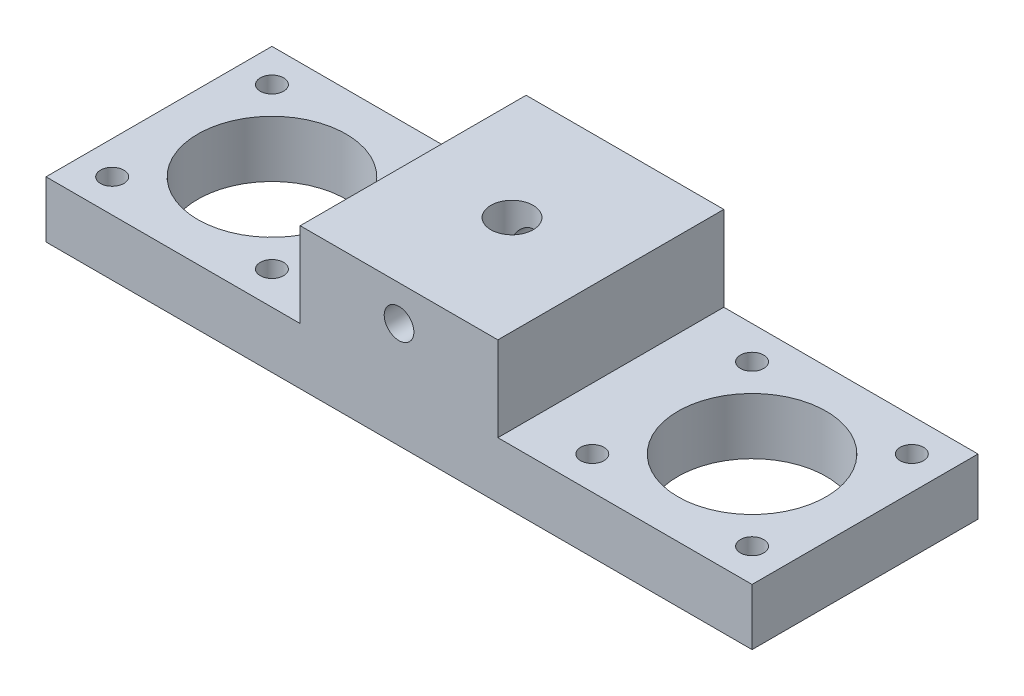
ISO-10303-21;
HEADER;
FILE_DESCRIPTION(('STEP AP214'),'2;1');
FILE_NAME('part.step','',(''),(''),'','','');
FILE_SCHEMA(('AUTOMOTIVE_DESIGN { 1 0 10303 214 1 1 1 1 }'));
ENDSEC;
DATA;
#1=APPLICATION_CONTEXT('core data for automotive mechanical design processes');
#2=APPLICATION_PROTOCOL_DEFINITION('international standard','automotive_design',2000,#1);
#3=PRODUCT_CONTEXT('',#1,'mechanical');
#4=PRODUCT('Part','Part','',(#3));
#5=PRODUCT_RELATED_PRODUCT_CATEGORY('part','',(#4));
#6=PRODUCT_DEFINITION_FORMATION('','',#4);
#7=PRODUCT_DEFINITION_CONTEXT('part definition',#1,'design');
#8=PRODUCT_DEFINITION('design','',#6,#7);
#9=PRODUCT_DEFINITION_SHAPE('','',#8);
#10=(LENGTH_UNIT() NAMED_UNIT(*) SI_UNIT(.MILLI.,.METRE.));
#11=(NAMED_UNIT(*) PLANE_ANGLE_UNIT() SI_UNIT($,.RADIAN.));
#12=(NAMED_UNIT(*) SI_UNIT($,.STERADIAN.) SOLID_ANGLE_UNIT());
#13=UNCERTAINTY_MEASURE_WITH_UNIT(LENGTH_MEASURE(1.E-05),#10,'distance_accuracy_value','');
#14=(GEOMETRIC_REPRESENTATION_CONTEXT(3) GLOBAL_UNCERTAINTY_ASSIGNED_CONTEXT((#13)) GLOBAL_UNIT_ASSIGNED_CONTEXT((#10,
#11,#12)) REPRESENTATION_CONTEXT('',''));
#15=CARTESIAN_POINT('',(0.,0.,0.));
#16=DIRECTION('',(0.,0.,1.));
#17=DIRECTION('',(1.,0.,0.));
#18=AXIS2_PLACEMENT_3D('',#15,#16,#17);
#19=CARTESIAN_POINT('',(0.,10.,0.));
#20=DIRECTION('',(0.,1.,0.));
#21=DIRECTION('',(0.,0.,1.));
#22=AXIS2_PLACEMENT_3D('',#19,#20,#21);
#23=CYLINDRICAL_SURFACE('',#22,3.);
#24=CARTESIAN_POINT('',(2.09999999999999,15.,2.14242852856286));
#25=CARTESIAN_POINT('',(2.09999935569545,15.0503500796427,2.14242969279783));
#26=CARTESIAN_POINT('',(2.09818319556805,15.1007182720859,2.14421462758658));
#27=CARTESIAN_POINT('',(2.09096784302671,15.2009663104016,2.15124967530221));
#28=CARTESIAN_POINT('',(2.08556595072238,15.2508457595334,2.15650239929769));
#29=CARTESIAN_POINT('',(2.06410630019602,15.3993103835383,2.17712653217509));
#30=CARTESIAN_POINT('',(2.04279523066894,15.4965210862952,2.19736230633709));
#31=CARTESIAN_POINT('',(1.98804341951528,15.6834534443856,2.24699824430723));
#32=CARTESIAN_POINT('',(1.95474567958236,15.7732486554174,2.27628981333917));
#33=CARTESIAN_POINT('',(1.87735088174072,15.9457731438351,2.34053116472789));
#34=CARTESIAN_POINT('',(1.83325566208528,16.0285036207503,2.3754799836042));
#35=CARTESIAN_POINT('',(1.72654194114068,16.2004219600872,2.45442194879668));
#36=CARTESIAN_POINT('',(1.66203137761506,16.2881996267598,2.4989266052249));
#37=CARTESIAN_POINT('',(1.52013071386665,16.4529396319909,2.58770730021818));
#38=CARTESIAN_POINT('',(1.44272540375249,16.5298889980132,2.63198300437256));
#39=CARTESIAN_POINT('',(1.26176132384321,16.6835329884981,2.723947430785));
#40=CARTESIAN_POINT('',(1.15599397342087,16.7580597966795,2.77098041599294));
#41=CARTESIAN_POINT('',(0.929495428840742,16.8875861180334,2.85491810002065));
#42=CARTESIAN_POINT('',(0.808785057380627,16.9426124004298,2.89183666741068));
#43=CARTESIAN_POINT('',(0.574412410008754,17.0231344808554,2.94658126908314));
#44=CARTESIAN_POINT('',(0.462309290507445,17.0517759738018,2.96641229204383));
#45=CARTESIAN_POINT('',(0.233454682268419,17.0901936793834,2.99311056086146));
#46=CARTESIAN_POINT('',(0.116709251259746,17.0999937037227,2.99999416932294));
#47=CARTESIAN_POINT('',(-0.104433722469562,17.1000056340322,3.00000521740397));
#48=CARTESIAN_POINT('',(-0.208838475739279,17.0921694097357,2.99450338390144));
#49=CARTESIAN_POINT('',(-0.414281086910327,17.06134982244,2.97305239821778));
#50=CARTESIAN_POINT('',(-0.515317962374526,17.0383620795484,2.95710022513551));
#51=CARTESIAN_POINT('',(-0.710737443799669,16.9787000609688,2.91629642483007));
#52=CARTESIAN_POINT('',(-0.805149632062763,16.9420919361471,2.89148783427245));
#53=CARTESIAN_POINT('',(-0.986035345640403,16.856810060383,2.83491211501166));
#54=CARTESIAN_POINT('',(-1.07250773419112,16.8081345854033,2.80314399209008));
#55=CARTESIAN_POINT('',(-1.24369991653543,16.695471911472,2.73176734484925));
#56=CARTESIAN_POINT('',(-1.32759007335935,16.6305119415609,2.69171411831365));
#57=CARTESIAN_POINT('',(-1.48403850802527,16.4895433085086,2.60873348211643));
#58=CARTESIAN_POINT('',(-1.5565797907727,16.4135183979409,2.56580189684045));
#59=CARTESIAN_POINT('',(-1.70136529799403,16.2371685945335,2.47264832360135));
#60=CARTESIAN_POINT('',(-1.77131287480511,16.1349215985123,2.4224722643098));
#61=CARTESIAN_POINT('',(-1.893093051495,15.9174256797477,2.32854122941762));
#62=CARTESIAN_POINT('',(-1.944950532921,15.8021949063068,2.28477748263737));
#63=CARTESIAN_POINT('',(-2.01523817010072,15.5972446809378,2.22268049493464));
#64=CARTESIAN_POINT('',(-2.03904064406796,15.5104897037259,2.20066282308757));
#65=CARTESIAN_POINT('',(-2.07540375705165,15.3329246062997,2.16641252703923));
#66=CARTESIAN_POINT('',(-2.08800521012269,15.2421304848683,2.15414439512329));
#67=CARTESIAN_POINT('',(-2.09639230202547,15.1255997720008,2.14595908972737));
#68=CARTESIAN_POINT('',(-2.09774348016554,15.1005235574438,2.14463816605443));
#69=CARTESIAN_POINT('',(-2.09954759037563,15.0502997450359,2.14287249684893));
#70=CARTESIAN_POINT('',(-2.10000032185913,15.0251521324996,2.14242794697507));
#71=CARTESIAN_POINT('',(-2.09999935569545,14.9496499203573,2.14242969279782));
#72=CARTESIAN_POINT('',(-2.09818319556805,14.8992817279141,2.14421462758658));
#73=CARTESIAN_POINT('',(-2.09096784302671,14.7990336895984,2.15124967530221));
#74=CARTESIAN_POINT('',(-2.08556595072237,14.7491542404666,2.15650239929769));
#75=CARTESIAN_POINT('',(-2.06410630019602,14.6006896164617,2.17712653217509));
#76=CARTESIAN_POINT('',(-2.04279523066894,14.5034789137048,2.19736230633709));
#77=CARTESIAN_POINT('',(-1.98804341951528,14.3165465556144,2.24699824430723));
#78=CARTESIAN_POINT('',(-1.95474567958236,14.2267513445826,2.27628981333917));
#79=CARTESIAN_POINT('',(-1.87735088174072,14.0542268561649,2.34053116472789));
#80=CARTESIAN_POINT('',(-1.83325566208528,13.9714963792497,2.3754799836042));
#81=CARTESIAN_POINT('',(-1.72654194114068,13.7995780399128,2.45442194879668));
#82=CARTESIAN_POINT('',(-1.66203137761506,13.7118003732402,2.4989266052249));
#83=CARTESIAN_POINT('',(-1.52013071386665,13.5470603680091,2.58770730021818));
#84=CARTESIAN_POINT('',(-1.44272540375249,13.4701110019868,2.63198300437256));
#85=CARTESIAN_POINT('',(-1.2617613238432,13.3164670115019,2.723947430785));
#86=CARTESIAN_POINT('',(-1.15599397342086,13.2419402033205,2.77098041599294));
#87=CARTESIAN_POINT('',(-0.929495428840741,13.1124138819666,2.85491810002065));
#88=CARTESIAN_POINT('',(-0.808785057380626,13.0573875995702,2.89183666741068));
#89=CARTESIAN_POINT('',(-0.574412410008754,12.9768655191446,2.94658126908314));
#90=CARTESIAN_POINT('',(-0.462309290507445,12.9482240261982,2.96641229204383));
#91=CARTESIAN_POINT('',(-0.23345468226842,12.9098063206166,2.99311056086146));
#92=CARTESIAN_POINT('',(-0.116709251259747,12.9000062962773,2.99999416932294));
#93=CARTESIAN_POINT('',(0.10443372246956,12.8999943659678,3.00000521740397));
#94=CARTESIAN_POINT('',(0.208838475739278,12.9078305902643,2.99450338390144));
#95=CARTESIAN_POINT('',(0.414281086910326,12.93865017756,2.97305239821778));
#96=CARTESIAN_POINT('',(0.515317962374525,12.9616379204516,2.95710022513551));
#97=CARTESIAN_POINT('',(0.710737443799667,13.0212999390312,2.91629642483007));
#98=CARTESIAN_POINT('',(0.80514963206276,13.0579080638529,2.89148783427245));
#99=CARTESIAN_POINT('',(0.9860353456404,13.143189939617,2.83491211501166));
#100=CARTESIAN_POINT('',(1.07250773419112,13.1918654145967,2.80314399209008));
#101=CARTESIAN_POINT('',(1.24369991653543,13.304528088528,2.73176734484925));
#102=CARTESIAN_POINT('',(1.32759007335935,13.3694880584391,2.69171411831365));
#103=CARTESIAN_POINT('',(1.48403850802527,13.5104566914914,2.60873348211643));
#104=CARTESIAN_POINT('',(1.5565797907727,13.5864816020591,2.56580189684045));
#105=CARTESIAN_POINT('',(1.70136529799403,13.7628314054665,2.47264832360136));
#106=CARTESIAN_POINT('',(1.77131287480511,13.8650784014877,2.4224722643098));
#107=CARTESIAN_POINT('',(1.893093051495,14.0825743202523,2.32854122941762));
#108=CARTESIAN_POINT('',(1.944950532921,14.1978050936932,2.28477748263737));
#109=CARTESIAN_POINT('',(2.01523817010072,14.4027553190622,2.22268049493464));
#110=CARTESIAN_POINT('',(2.03904064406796,14.4895102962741,2.20066282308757));
#111=CARTESIAN_POINT('',(2.07540375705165,14.6670753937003,2.16641252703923));
#112=CARTESIAN_POINT('',(2.08800521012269,14.7578695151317,2.15414439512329));
#113=CARTESIAN_POINT('',(2.09639230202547,14.8744002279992,2.14595908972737));
#114=CARTESIAN_POINT('',(2.09774348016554,14.8994764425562,2.14463816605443));
#115=CARTESIAN_POINT('',(2.09954759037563,14.9497002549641,2.14287249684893));
#116=CARTESIAN_POINT('',(2.10000032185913,14.9748478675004,2.14242794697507));
#117=CARTESIAN_POINT('',(2.09999999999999,15.,2.14242852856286));
#118=B_SPLINE_CURVE_WITH_KNOTS('',3,(#24,#25,#26,#27,#28,#29,#30,#31,#32,#33,#34,#35,#36,#37,
#38,#39,#40,#41,#42,#43,#44,#45,#46,#47,#48,#49,#50,#51,#52,#53,#54,#55,#56,#57,#58,#59,#60,#61,
#62,#63,#64,#65,#66,#67,#68,#69,#70,#71,#72,#73,#74,#75,#76,#77,#78,#79,#80,#81,#82,#83,#84,#85,
#86,#87,#88,#89,#90,#91,#92,#93,#94,#95,#96,#97,#98,#99,#100,#101,#102,#103,#104,#105,#106,#107,
#108,#109,#110,#111,#112,#113,#114,#115,#116,#117),.UNSPECIFIED.,.T.,.F.,(4,2,2,2,2,2,2,2,2,2,2,
2,2,2,2,2,2,2,2,2,2,2,2,2,2,2,2,2,2,2,2,2,2,2,2,2,2,2,2,2,2,2,2,2,2,2,4),(0.,0.151013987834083,
0.302141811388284,0.604989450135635,0.904337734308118,1.20363509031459,1.55539742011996,
1.90757764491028,2.31828952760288,2.72843540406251,3.07848062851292,3.42808317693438,
3.74091438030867,4.05383605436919,4.3652573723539,4.67672320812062,5.01570368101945,
5.35518702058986,5.75438428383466,6.15303029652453,6.42985740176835,6.70567162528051,
6.78109307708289,6.85653136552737,7.00754535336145,7.15867317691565,7.461520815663,
7.76086909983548,8.06016645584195,8.41192878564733,8.76410901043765,9.17482089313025,
9.58496676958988,9.93501199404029,10.2846145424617,10.597445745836,10.9103674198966,
11.2217887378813,11.533254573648,11.8722350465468,12.2117183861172,12.610915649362,
13.0095616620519,13.2863887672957,13.5622029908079,13.6376244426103,13.7130627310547),.UNSPECIFIED.);
#119=CARTESIAN_POINT('',(2.09999999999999,15.,2.14242852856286));
#120=VERTEX_POINT('',#119);
#121=EDGE_CURVE('E194',#120,#120,#118,.T.);
#122=ORIENTED_EDGE('',*,*,#121,.T.);
#123=EDGE_LOOP('',(#122));
#124=FACE_BOUND('',#123,.T.);
#125=CARTESIAN_POINT('',(0.,20.,0.));
#126=DIRECTION('',(0.,1.,0.));
#127=DIRECTION('',(0.,0.,1.));
#128=AXIS2_PLACEMENT_3D('',#125,#126,#127);
#129=CIRCLE('',#128,3.);
#130=CARTESIAN_POINT('',(0.,20.,3.));
#131=VERTEX_POINT('',#130);
#132=EDGE_CURVE('E122',#131,#131,#129,.F.);
#133=ORIENTED_EDGE('',*,*,#132,.F.);
#134=EDGE_LOOP('',(#133));
#135=FACE_BOUND('',#134,.T.);
#136=CARTESIAN_POINT('',(-2.09999999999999,15.,-2.14242852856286));
#137=CARTESIAN_POINT('',(-2.09999935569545,15.0503500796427,-2.14242969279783));
#138=CARTESIAN_POINT('',(-2.09818319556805,15.1007182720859,-2.14421462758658));
#139=CARTESIAN_POINT('',(-2.09096784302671,15.2009663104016,-2.15124967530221));
#140=CARTESIAN_POINT('',(-2.08556595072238,15.2508457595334,-2.15650239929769));
#141=CARTESIAN_POINT('',(-2.06410630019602,15.3993103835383,-2.17712653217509));
#142=CARTESIAN_POINT('',(-2.04279523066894,15.4965210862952,-2.19736230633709));
#143=CARTESIAN_POINT('',(-1.98804341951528,15.6834534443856,-2.24699824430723));
#144=CARTESIAN_POINT('',(-1.95474567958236,15.7732486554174,-2.27628981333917));
#145=CARTESIAN_POINT('',(-1.87735088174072,15.9457731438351,-2.34053116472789));
#146=CARTESIAN_POINT('',(-1.83325566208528,16.0285036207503,-2.3754799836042));
#147=CARTESIAN_POINT('',(-1.72654194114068,16.2004219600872,-2.45442194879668));
#148=CARTESIAN_POINT('',(-1.66203137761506,16.2881996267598,-2.4989266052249));
#149=CARTESIAN_POINT('',(-1.52013071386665,16.4529396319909,-2.58770730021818));
#150=CARTESIAN_POINT('',(-1.44272540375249,16.5298889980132,-2.63198300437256));
#151=CARTESIAN_POINT('',(-1.2617613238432,16.6835329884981,-2.723947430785));
#152=CARTESIAN_POINT('',(-1.15599397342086,16.7580597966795,-2.77098041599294));
#153=CARTESIAN_POINT('',(-0.929495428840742,16.8875861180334,-2.85491810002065));
#154=CARTESIAN_POINT('',(-0.808785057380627,16.9426124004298,-2.89183666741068));
#155=CARTESIAN_POINT('',(-0.574412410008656,17.0231344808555,-2.94658126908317));
#156=CARTESIAN_POINT('',(-0.462309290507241,17.0517759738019,-2.96641229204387));
#157=CARTESIAN_POINT('',(-0.233454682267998,17.0901936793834,-2.99311056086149));
#158=CARTESIAN_POINT('',(-0.116709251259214,17.0999937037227,-2.99999416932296));
#159=CARTESIAN_POINT('',(0.104433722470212,17.1000056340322,-3.00000521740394));
#160=CARTESIAN_POINT('',(0.208838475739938,17.0921694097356,-2.9945033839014));
#161=CARTESIAN_POINT('',(0.414281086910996,17.0613498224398,-2.97305239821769));
#162=CARTESIAN_POINT('',(0.515317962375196,17.0383620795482,-2.95710022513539));
#163=CARTESIAN_POINT('',(0.710737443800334,16.9787000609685,-2.91629642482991));
#164=CARTESIAN_POINT('',(0.80514963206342,16.9420919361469,-2.89148783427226));
#165=CARTESIAN_POINT('',(0.986035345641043,16.8568100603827,-2.83491211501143));
#166=CARTESIAN_POINT('',(1.07250773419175,16.808134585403,-2.80314399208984));
#167=CARTESIAN_POINT('',(1.24369991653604,16.6954719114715,-2.73176734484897));
#168=CARTESIAN_POINT('',(1.32759007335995,16.6305119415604,-2.69171411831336));
#169=CARTESIAN_POINT('',(1.48403850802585,16.489543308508,-2.60873348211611));
#170=CARTESIAN_POINT('',(1.55657979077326,16.4135183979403,-2.56580189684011));
#171=CARTESIAN_POINT('',(1.70136529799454,16.2371685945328,-2.472648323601));
#172=CARTESIAN_POINT('',(1.7713128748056,16.1349215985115,-2.42247226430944));
#173=CARTESIAN_POINT('',(1.89309305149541,15.9174256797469,-2.32854122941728));
#174=CARTESIAN_POINT('',(1.94495053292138,15.8021949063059,-2.28477748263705));
#175=CARTESIAN_POINT('',(2.015238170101,15.5972446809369,-2.22268049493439));
#176=CARTESIAN_POINT('',(2.03904064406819,15.510489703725,-2.20066282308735));
#177=CARTESIAN_POINT('',(2.0754037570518,15.3329246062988,-2.16641252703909));
#178=CARTESIAN_POINT('',(2.0880052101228,15.2421304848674,-2.15414439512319));
#179=CARTESIAN_POINT('',(2.09639230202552,15.1255997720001,-2.14595908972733));
#180=CARTESIAN_POINT('',(2.09774348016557,15.1005235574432,-2.1446381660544));
#181=CARTESIAN_POINT('',(2.09954759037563,15.0502997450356,-2.14287249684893));
#182=CARTESIAN_POINT('',(2.10000032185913,15.0251521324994,-2.14242794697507));
#183=CARTESIAN_POINT('',(2.09999935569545,14.9496499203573,-2.14242969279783));
#184=CARTESIAN_POINT('',(2.09818319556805,14.8992817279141,-2.14421462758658));
#185=CARTESIAN_POINT('',(2.09096784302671,14.7990336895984,-2.15124967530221));
#186=CARTESIAN_POINT('',(2.08556595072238,14.7491542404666,-2.15650239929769));
#187=CARTESIAN_POINT('',(2.06410630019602,14.6006896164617,-2.17712653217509));
#188=CARTESIAN_POINT('',(2.04279523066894,14.5034789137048,-2.19736230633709));
#189=CARTESIAN_POINT('',(1.98804341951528,14.3165465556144,-2.24699824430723));
#190=CARTESIAN_POINT('',(1.95474567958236,14.2267513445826,-2.27628981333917));
#191=CARTESIAN_POINT('',(1.87735088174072,14.0542268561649,-2.34053116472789));
#192=CARTESIAN_POINT('',(1.83325566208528,13.9714963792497,-2.3754799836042));
#193=CARTESIAN_POINT('',(1.72654194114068,13.7995780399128,-2.45442194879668));
#194=CARTESIAN_POINT('',(1.66203137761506,13.7118003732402,-2.4989266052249));
#195=CARTESIAN_POINT('',(1.52013071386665,13.5470603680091,-2.58770730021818));
#196=CARTESIAN_POINT('',(1.44272540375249,13.4701110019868,-2.63198300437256));
#197=CARTESIAN_POINT('',(1.26176132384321,13.3164670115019,-2.723947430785));
#198=CARTESIAN_POINT('',(1.15599397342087,13.2419402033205,-2.77098041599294));
#199=CARTESIAN_POINT('',(0.929495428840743,13.1124138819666,-2.85491810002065));
#200=CARTESIAN_POINT('',(0.808785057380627,13.0573875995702,-2.89183666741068));
#201=CARTESIAN_POINT('',(0.574412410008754,12.9768655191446,-2.94658126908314));
#202=CARTESIAN_POINT('',(0.462309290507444,12.9482240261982,-2.96641229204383));
#203=CARTESIAN_POINT('',(0.23345468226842,12.9098063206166,-2.99311056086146));
#204=CARTESIAN_POINT('',(0.116709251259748,12.9000062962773,-2.99999416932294));
#205=CARTESIAN_POINT('',(-0.104433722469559,12.8999943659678,-3.00000521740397));
#206=CARTESIAN_POINT('',(-0.208838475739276,12.9078305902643,-2.99450338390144));
#207=CARTESIAN_POINT('',(-0.414281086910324,12.93865017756,-2.97305239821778));
#208=CARTESIAN_POINT('',(-0.515317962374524,12.9616379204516,-2.95710022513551));
#209=CARTESIAN_POINT('',(-0.710737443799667,13.0212999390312,-2.91629642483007));
#210=CARTESIAN_POINT('',(-0.805149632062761,13.0579080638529,-2.89148783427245));
#211=CARTESIAN_POINT('',(-0.986035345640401,13.143189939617,-2.83491211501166));
#212=CARTESIAN_POINT('',(-1.07250773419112,13.1918654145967,-2.80314399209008));
#213=CARTESIAN_POINT('',(-1.24369991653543,13.304528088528,-2.73176734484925));
#214=CARTESIAN_POINT('',(-1.32759007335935,13.3694880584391,-2.69171411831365));
#215=CARTESIAN_POINT('',(-1.48403850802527,13.5104566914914,-2.60873348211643));
#216=CARTESIAN_POINT('',(-1.5565797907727,13.5864816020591,-2.56580189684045));
#217=CARTESIAN_POINT('',(-1.70136529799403,13.7628314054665,-2.47264832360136));
#218=CARTESIAN_POINT('',(-1.77131287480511,13.8650784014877,-2.4224722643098));
#219=CARTESIAN_POINT('',(-1.893093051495,14.0825743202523,-2.32854122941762));
#220=CARTESIAN_POINT('',(-1.944950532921,14.1978050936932,-2.28477748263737));
#221=CARTESIAN_POINT('',(-2.01523817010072,14.4027553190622,-2.22268049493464));
#222=CARTESIAN_POINT('',(-2.03904064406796,14.4895102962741,-2.20066282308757));
#223=CARTESIAN_POINT('',(-2.07540375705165,14.6670753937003,-2.16641252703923));
#224=CARTESIAN_POINT('',(-2.08800521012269,14.7578695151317,-2.15414439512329));
#225=CARTESIAN_POINT('',(-2.09639230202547,14.8744002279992,-2.14595908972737));
#226=CARTESIAN_POINT('',(-2.09774348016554,14.8994764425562,-2.14463816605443));
#227=CARTESIAN_POINT('',(-2.09954759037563,14.9497002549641,-2.14287249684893));
#228=CARTESIAN_POINT('',(-2.10000032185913,14.9748478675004,-2.14242794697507));
#229=CARTESIAN_POINT('',(-2.09999999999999,15.,-2.14242852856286));
#230=B_SPLINE_CURVE_WITH_KNOTS('',3,(#136,#137,#138,#139,#140,#141,#142,#143,#144,#145,#146,
#147,#148,#149,#150,#151,#152,#153,#154,#155,#156,#157,#158,#159,#160,#161,#162,#163,#164,#165,
#166,#167,#168,#169,#170,#171,#172,#173,#174,#175,#176,#177,#178,#179,#180,#181,#182,#183,#184,
#185,#186,#187,#188,#189,#190,#191,#192,#193,#194,#195,#196,#197,#198,#199,#200,#201,#202,#203,
#204,#205,#206,#207,#208,#209,#210,#211,#212,#213,#214,#215,#216,#217,#218,#219,#220,#221,#222,
#223,#224,#225,#226,#227,#228,#229),.UNSPECIFIED.,.T.,.F.,(4,2,2,2,2,2,2,2,2,2,2,2,2,2,2,2,2,2,
2,2,2,2,2,2,2,2,2,2,2,2,2,2,2,2,2,2,2,2,2,2,2,2,2,2,2,2,4),(0.,0.151013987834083,
0.302141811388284,0.604989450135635,0.904337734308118,1.20363509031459,1.55539742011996,
1.90757764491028,2.31828952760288,2.72843540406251,3.07848062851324,3.42808317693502,
3.74091438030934,4.0538360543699,4.36525737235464,4.6767232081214,5.0157036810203,
5.35518702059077,5.75438428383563,6.15303029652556,6.42985740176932,6.70567162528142,
6.78109307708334,6.85653136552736,7.00754535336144,7.15867317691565,7.461520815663,
7.76086909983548,8.06016645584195,8.41192878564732,8.76410901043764,9.17482089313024,
9.58496676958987,9.93501199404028,10.2846145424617,10.597445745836,10.9103674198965,
11.2217887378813,11.533254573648,11.8722350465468,12.2117183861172,12.610915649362,
13.0095616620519,13.2863887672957,13.5622029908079,13.6376244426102,13.7130627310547),.UNSPECIFIED.);
#231=CARTESIAN_POINT('',(-2.09999999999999,15.,-2.14242852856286));
#232=VERTEX_POINT('',#231);
#233=EDGE_CURVE('E199',#232,#232,#230,.T.);
#234=ORIENTED_EDGE('',*,*,#233,.T.);
#235=EDGE_LOOP('',(#234));
#236=FACE_BOUND('',#235,.T.);
#237=CARTESIAN_POINT('',(0.,10.,0.));
#238=DIRECTION('',(0.,1.,0.));
#239=DIRECTION('',(0.,0.,1.));
#240=AXIS2_PLACEMENT_3D('',#237,#238,#239);
#241=CIRCLE('',#240,3.);
#242=CARTESIAN_POINT('',(0.,10.,3.));
#243=VERTEX_POINT('',#242);
#244=EDGE_CURVE('E21',#243,#243,#241,.T.);
#245=ORIENTED_EDGE('',*,*,#244,.F.);
#246=EDGE_LOOP('',(#245));
#247=FACE_BOUND('',#246,.T.);
#248=ADVANCED_FACE('F17',(#124,#135,#236,#247),#23,.F.);
#249=CARTESIAN_POINT('',(0.,10.,0.));
#250=DIRECTION('',(0.,1.,0.));
#251=DIRECTION('',(0.,0.,1.));
#252=AXIS2_PLACEMENT_3D('',#249,#250,#251);
#253=PLANE('',#252);
#254=ORIENTED_EDGE('',*,*,#244,.T.);
#255=EDGE_LOOP('',(#254));
#256=FACE_BOUND('',#255,.T.);
#257=CARTESIAN_POINT('',(0.,10.,0.));
#258=DIRECTION('',(0.,-1.,0.));
#259=DIRECTION('',(0.,0.,-1.));
#260=AXIS2_PLACEMENT_3D('',#257,#258,#259);
#261=CIRCLE('',#260,2.5);
#262=CARTESIAN_POINT('',(0.,10.,-2.5));
#263=VERTEX_POINT('',#262);
#264=EDGE_CURVE('E118',#263,#263,#261,.T.);
#265=ORIENTED_EDGE('',*,*,#264,.T.);
#266=EDGE_LOOP('',(#265));
#267=FACE_BOUND('',#266,.T.);
#268=ADVANCED_FACE('F213',(#256,#267),#253,.T.);
#269=CARTESIAN_POINT('',(0.,15.,16.));
#270=DIRECTION('',(0.,0.,1.));
#271=DIRECTION('',(1.,0.,0.));
#272=AXIS2_PLACEMENT_3D('',#269,#270,#271);
#273=CYLINDRICAL_SURFACE('',#272,2.09999999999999);
#274=CARTESIAN_POINT('',(0.,15.,-16.));
#275=DIRECTION('',(0.,0.,1.));
#276=DIRECTION('',(1.,0.,0.));
#277=AXIS2_PLACEMENT_3D('',#274,#275,#276);
#278=CIRCLE('',#277,2.09999999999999);
#279=CARTESIAN_POINT('',(2.09999999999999,15.,-16.));
#280=VERTEX_POINT('',#279);
#281=EDGE_CURVE('E111',#280,#280,#278,.F.);
#282=ORIENTED_EDGE('',*,*,#281,.T.);
#283=EDGE_LOOP('',(#282));
#284=FACE_BOUND('',#283,.T.);
#285=ORIENTED_EDGE('',*,*,#233,.F.);
#286=EDGE_LOOP('',(#285));
#287=FACE_BOUND('',#286,.T.);
#288=ADVANCED_FACE('F208',(#284,#287),#273,.F.);
#289=CARTESIAN_POINT('',(0.,15.,16.));
#290=DIRECTION('',(0.,0.,1.));
#291=DIRECTION('',(1.,0.,0.));
#292=AXIS2_PLACEMENT_3D('',#289,#290,#291);
#293=CYLINDRICAL_SURFACE('',#292,2.09999999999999);
#294=ORIENTED_EDGE('',*,*,#121,.F.);
#295=EDGE_LOOP('',(#294));
#296=FACE_BOUND('',#295,.T.);
#297=CARTESIAN_POINT('',(0.,15.,16.));
#298=DIRECTION('',(0.,0.,1.));
#299=DIRECTION('',(1.,0.,0.));
#300=AXIS2_PLACEMENT_3D('',#297,#298,#299);
#301=CIRCLE('',#300,2.09999999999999);
#302=CARTESIAN_POINT('',(2.09999999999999,15.,16.));
#303=VERTEX_POINT('',#302);
#304=EDGE_CURVE('E171',#303,#303,#301,.T.);
#305=ORIENTED_EDGE('',*,*,#304,.T.);
#306=EDGE_LOOP('',(#305));
#307=FACE_BOUND('',#306,.T.);
#308=ADVANCED_FACE('F203',(#296,#307),#293,.F.);
#309=CARTESIAN_POINT('',(-14.,0.,-16.));
#310=DIRECTION('',(-1.,0.,0.));
#311=DIRECTION('',(0.,0.,1.));
#312=AXIS2_PLACEMENT_3D('',#309,#310,#311);
#313=PLANE('',#312);
#314=DIRECTION('',(0.,1.,0.));
#315=VECTOR('',#314,1.);
#316=CARTESIAN_POINT('',(-14.,8.,16.));
#317=LINE('',#316,#315);
#318=CARTESIAN_POINT('',(-14.,8.,16.));
#319=VERTEX_POINT('',#318);
#320=CARTESIAN_POINT('',(-14.,20.,16.));
#321=VERTEX_POINT('',#320);
#322=EDGE_CURVE('E317',#319,#321,#317,.T.);
#323=ORIENTED_EDGE('',*,*,#322,.T.);
#324=DIRECTION('',(0.,0.,1.));
#325=VECTOR('',#324,1.);
#326=CARTESIAN_POINT('',(-14.,20.,0.));
#327=LINE('',#326,#325);
#328=CARTESIAN_POINT('',(-14.,20.,-16.));
#329=VERTEX_POINT('',#328);
#330=EDGE_CURVE('E121',#329,#321,#327,.T.);
#331=ORIENTED_EDGE('',*,*,#330,.F.);
#332=DIRECTION('',(0.,1.,0.));
#333=VECTOR('',#332,1.);
#334=CARTESIAN_POINT('',(-14.,8.,-16.));
#335=LINE('',#334,#333);
#336=CARTESIAN_POINT('',(-14.,8.,-16.));
#337=VERTEX_POINT('',#336);
#338=EDGE_CURVE('E336',#329,#337,#335,.F.);
#339=ORIENTED_EDGE('',*,*,#338,.T.);
#340=DIRECTION('',(0.,0.,1.));
#341=VECTOR('',#340,1.);
#342=CARTESIAN_POINT('',(-14.,8.,0.));
#343=LINE('',#342,#341);
#344=EDGE_CURVE('E96',#319,#337,#343,.F.);
#345=ORIENTED_EDGE('',*,*,#344,.F.);
#346=EDGE_LOOP('',(#323,#331,#339,#345));
#347=FACE_BOUND('',#346,.T.);
#348=ADVANCED_FACE('F207',(#347),#313,.T.);
#349=CARTESIAN_POINT('',(0.,20.,0.));
#350=DIRECTION('',(0.,1.,0.));
#351=DIRECTION('',(0.,0.,1.));
#352=AXIS2_PLACEMENT_3D('',#349,#350,#351);
#353=PLANE('',#352);
#354=DIRECTION('',(0.,0.,-1.));
#355=VECTOR('',#354,1.);
#356=CARTESIAN_POINT('',(14.,20.,-16.));
#357=LINE('',#356,#355);
#358=CARTESIAN_POINT('',(14.,20.,-16.));
#359=VERTEX_POINT('',#358);
#360=CARTESIAN_POINT('',(14.,20.,16.));
#361=VERTEX_POINT('',#360);
#362=EDGE_CURVE('E81',#359,#361,#357,.F.);
#363=ORIENTED_EDGE('',*,*,#362,.F.);
#364=DIRECTION('',(1.,0.,0.));
#365=VECTOR('',#364,1.);
#366=CARTESIAN_POINT('',(-50.,20.,-16.));
#367=LINE('',#366,#365);
#368=EDGE_CURVE('E106',#359,#329,#367,.F.);
#369=ORIENTED_EDGE('',*,*,#368,.T.);
#370=ORIENTED_EDGE('',*,*,#330,.T.);
#371=DIRECTION('',(-1.,0.,0.));
#372=VECTOR('',#371,1.);
#373=CARTESIAN_POINT('',(-50.,20.,16.));
#374=LINE('',#373,#372);
#375=EDGE_CURVE('E322',#321,#361,#374,.F.);
#376=ORIENTED_EDGE('',*,*,#375,.T.);
#377=EDGE_LOOP('',(#363,#369,#370,#376));
#378=FACE_BOUND('',#377,.T.);
#379=ORIENTED_EDGE('',*,*,#132,.T.);
#380=EDGE_LOOP('',(#379));
#381=FACE_BOUND('',#380,.T.);
#382=ADVANCED_FACE('F298',(#378,#381),#353,.T.);
#383=CARTESIAN_POINT('',(14.,0.,-16.));
#384=DIRECTION('',(1.,0.,0.));
#385=DIRECTION('',(0.,0.,-1.));
#386=AXIS2_PLACEMENT_3D('',#383,#384,#385);
#387=PLANE('',#386);
#388=DIRECTION('',(0.,1.,0.));
#389=VECTOR('',#388,1.);
#390=CARTESIAN_POINT('',(14.,8.,-16.));
#391=LINE('',#390,#389);
#392=CARTESIAN_POINT('',(14.,8.,-16.));
#393=VERTEX_POINT('',#392);
#394=EDGE_CURVE('E90',#393,#359,#391,.T.);
#395=ORIENTED_EDGE('',*,*,#394,.T.);
#396=ORIENTED_EDGE('',*,*,#362,.T.);
#397=DIRECTION('',(0.,1.,0.));
#398=VECTOR('',#397,1.);
#399=CARTESIAN_POINT('',(14.,8.,16.));
#400=LINE('',#399,#398);
#401=CARTESIAN_POINT('',(14.,8.,16.));
#402=VERTEX_POINT('',#401);
#403=EDGE_CURVE('E92',#361,#402,#400,.F.);
#404=ORIENTED_EDGE('',*,*,#403,.T.);
#405=DIRECTION('',(0.,0.,1.));
#406=VECTOR('',#405,1.);
#407=CARTESIAN_POINT('',(14.,8.,0.));
#408=LINE('',#407,#406);
#409=EDGE_CURVE('E87',#393,#402,#408,.T.);
#410=ORIENTED_EDGE('',*,*,#409,.F.);
#411=EDGE_LOOP('',(#395,#396,#404,#410));
#412=FACE_BOUND('',#411,.T.);
#413=ADVANCED_FACE('F89',(#412),#387,.T.);
#414=CARTESIAN_POINT('',(0.,8.,0.));
#415=DIRECTION('',(0.,1.,0.));
#416=DIRECTION('',(0.,0.,1.));
#417=AXIS2_PLACEMENT_3D('',#414,#415,#416);
#418=PLANE('',#417);
#419=CARTESIAN_POINT('',(34.,8.,0.));
#420=DIRECTION('',(0.,1.,0.));
#421=DIRECTION('',(0.,0.,1.));
#422=AXIS2_PLACEMENT_3D('',#419,#420,#421);
#423=CIRCLE('',#422,10.5);
#424=CARTESIAN_POINT('',(34.,8.,10.5));
#425=VERTEX_POINT('',#424);
#426=EDGE_CURVE('E114',#425,#425,#423,.F.);
#427=ORIENTED_EDGE('',*,*,#426,.T.);
#428=EDGE_LOOP('',(#427));
#429=FACE_BOUND('',#428,.T.);
#430=CARTESIAN_POINT('',(45.3137084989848,8.,-11.3137084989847));
#431=DIRECTION('',(0.,1.,0.));
#432=DIRECTION('',(0.,0.,1.));
#433=AXIS2_PLACEMENT_3D('',#430,#431,#432);
#434=CIRCLE('',#433,1.64999999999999);
#435=CARTESIAN_POINT('',(45.3137084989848,8.,-9.66370849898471));
#436=VERTEX_POINT('',#435);
#437=EDGE_CURVE('E178',#436,#436,#434,.F.);
#438=ORIENTED_EDGE('',*,*,#437,.T.);
#439=EDGE_LOOP('',(#438));
#440=FACE_BOUND('',#439,.T.);
#441=CARTESIAN_POINT('',(45.3137084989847,8.,11.3137084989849));
#442=DIRECTION('',(0.,1.,0.));
#443=DIRECTION('',(0.,0.,1.));
#444=AXIS2_PLACEMENT_3D('',#441,#442,#443);
#445=CIRCLE('',#444,1.64999999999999);
#446=CARTESIAN_POINT('',(45.3137084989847,8.,12.9637084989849));
#447=VERTEX_POINT('',#446);
#448=EDGE_CURVE('E181',#447,#447,#445,.F.);
#449=ORIENTED_EDGE('',*,*,#448,.T.);
#450=EDGE_LOOP('',(#449));
#451=FACE_BOUND('',#450,.T.);
#452=CARTESIAN_POINT('',(22.6862915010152,8.,11.3137084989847));
#453=DIRECTION('',(0.,1.,0.));
#454=DIRECTION('',(0.,0.,1.));
#455=AXIS2_PLACEMENT_3D('',#452,#453,#454);
#456=CIRCLE('',#455,1.64999999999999);
#457=CARTESIAN_POINT('',(22.6862915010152,8.,12.9637084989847));
#458=VERTEX_POINT('',#457);
#459=EDGE_CURVE('E184',#458,#458,#456,.F.);
#460=ORIENTED_EDGE('',*,*,#459,.T.);
#461=EDGE_LOOP('',(#460));
#462=FACE_BOUND('',#461,.T.);
#463=CARTESIAN_POINT('',(22.6862915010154,8.,-11.3137084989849));
#464=DIRECTION('',(0.,1.,0.));
#465=DIRECTION('',(0.,0.,1.));
#466=AXIS2_PLACEMENT_3D('',#463,#464,#465);
#467=CIRCLE('',#466,1.64999999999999);
#468=CARTESIAN_POINT('',(22.6862915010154,8.,-9.66370849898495));
#469=VERTEX_POINT('',#468);
#470=EDGE_CURVE('E187',#469,#469,#467,.F.);
#471=ORIENTED_EDGE('',*,*,#470,.T.);
#472=EDGE_LOOP('',(#471));
#473=FACE_BOUND('',#472,.T.);
#474=DIRECTION('',(0.,0.,1.));
#475=VECTOR('',#474,1.);
#476=CARTESIAN_POINT('',(50.,8.,-16.));
#477=LINE('',#476,#475);
#478=CARTESIAN_POINT('',(50.,8.,16.));
#479=VERTEX_POINT('',#478);
#480=CARTESIAN_POINT('',(50.,8.,-16.));
#481=VERTEX_POINT('',#480);
#482=EDGE_CURVE('E110',#479,#481,#477,.F.);
#483=ORIENTED_EDGE('',*,*,#482,.T.);
#484=DIRECTION('',(1.,0.,0.));
#485=VECTOR('',#484,1.);
#486=CARTESIAN_POINT('',(-50.,8.,-16.));
#487=LINE('',#486,#485);
#488=EDGE_CURVE('E103',#481,#393,#487,.F.);
#489=ORIENTED_EDGE('',*,*,#488,.T.);
#490=ORIENTED_EDGE('',*,*,#409,.T.);
#491=DIRECTION('',(-1.,0.,0.));
#492=VECTOR('',#491,1.);
#493=CARTESIAN_POINT('',(-50.,8.,16.));
#494=LINE('',#493,#492);
#495=EDGE_CURVE('E338',#402,#479,#494,.F.);
#496=ORIENTED_EDGE('',*,*,#495,.T.);
#497=EDGE_LOOP('',(#483,#489,#490,#496));
#498=FACE_BOUND('',#497,.T.);
#499=ADVANCED_FACE('F109',(#429,#440,#451,#462,#473,#498),#418,.T.);
#500=CARTESIAN_POINT('',(0.,8.,0.));
#501=DIRECTION('',(0.,1.,0.));
#502=DIRECTION('',(0.,0.,1.));
#503=AXIS2_PLACEMENT_3D('',#500,#501,#502);
#504=PLANE('',#503);
#505=CARTESIAN_POINT('',(-22.6862915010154,8.,-11.3137084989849));
#506=DIRECTION('',(0.,1.,0.));
#507=DIRECTION('',(0.,0.,1.));
#508=AXIS2_PLACEMENT_3D('',#505,#506,#507);
#509=CIRCLE('',#508,1.64999999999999);
#510=CARTESIAN_POINT('',(-22.6862915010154,8.,-9.66370849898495));
#511=VERTEX_POINT('',#510);
#512=EDGE_CURVE('E155',#511,#511,#509,.F.);
#513=ORIENTED_EDGE('',*,*,#512,.T.);
#514=EDGE_LOOP('',(#513));
#515=FACE_BOUND('',#514,.T.);
#516=CARTESIAN_POINT('',(-22.6862915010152,8.,11.3137084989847));
#517=DIRECTION('',(0.,1.,0.));
#518=DIRECTION('',(0.,0.,1.));
#519=AXIS2_PLACEMENT_3D('',#516,#517,#518);
#520=CIRCLE('',#519,1.64999999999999);
#521=CARTESIAN_POINT('',(-22.6862915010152,8.,12.9637084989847));
#522=VERTEX_POINT('',#521);
#523=EDGE_CURVE('E158',#522,#522,#520,.F.);
#524=ORIENTED_EDGE('',*,*,#523,.T.);
#525=EDGE_LOOP('',(#524));
#526=FACE_BOUND('',#525,.T.);
#527=CARTESIAN_POINT('',(-45.3137084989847,8.,11.3137084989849));
#528=DIRECTION('',(0.,1.,0.));
#529=DIRECTION('',(0.,0.,1.));
#530=AXIS2_PLACEMENT_3D('',#527,#528,#529);
#531=CIRCLE('',#530,1.64999999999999);
#532=CARTESIAN_POINT('',(-45.3137084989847,8.,12.9637084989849));
#533=VERTEX_POINT('',#532);
#534=EDGE_CURVE('E161',#533,#533,#531,.F.);
#535=ORIENTED_EDGE('',*,*,#534,.T.);
#536=EDGE_LOOP('',(#535));
#537=FACE_BOUND('',#536,.T.);
#538=CARTESIAN_POINT('',(-45.3137084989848,8.,-11.3137084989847));
#539=DIRECTION('',(0.,1.,0.));
#540=DIRECTION('',(0.,0.,1.));
#541=AXIS2_PLACEMENT_3D('',#538,#539,#540);
#542=CIRCLE('',#541,1.64999999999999);
#543=CARTESIAN_POINT('',(-45.3137084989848,8.,-9.66370849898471));
#544=VERTEX_POINT('',#543);
#545=EDGE_CURVE('E164',#544,#544,#542,.F.);
#546=ORIENTED_EDGE('',*,*,#545,.T.);
#547=EDGE_LOOP('',(#546));
#548=FACE_BOUND('',#547,.T.);
#549=CARTESIAN_POINT('',(-34.,8.,0.));
#550=DIRECTION('',(0.,1.,0.));
#551=DIRECTION('',(0.,0.,1.));
#552=AXIS2_PLACEMENT_3D('',#549,#550,#551);
#553=CIRCLE('',#552,10.5);
#554=CARTESIAN_POINT('',(-34.,8.,10.5));
#555=VERTEX_POINT('',#554);
#556=EDGE_CURVE('E167',#555,#555,#553,.F.);
#557=ORIENTED_EDGE('',*,*,#556,.T.);
#558=EDGE_LOOP('',(#557));
#559=FACE_BOUND('',#558,.T.);
#560=DIRECTION('',(0.,0.,-1.));
#561=VECTOR('',#560,1.);
#562=CARTESIAN_POINT('',(-50.,8.,-16.));
#563=LINE('',#562,#561);
#564=CARTESIAN_POINT('',(-50.,8.,-16.));
#565=VERTEX_POINT('',#564);
#566=CARTESIAN_POINT('',(-50.,8.,16.));
#567=VERTEX_POINT('',#566);
#568=EDGE_CURVE('E174',#565,#567,#563,.F.);
#569=ORIENTED_EDGE('',*,*,#568,.T.);
#570=DIRECTION('',(-1.,0.,0.));
#571=VECTOR('',#570,1.);
#572=CARTESIAN_POINT('',(-50.,8.,16.));
#573=LINE('',#572,#571);
#574=EDGE_CURVE('E323',#567,#319,#573,.F.);
#575=ORIENTED_EDGE('',*,*,#574,.T.);
#576=ORIENTED_EDGE('',*,*,#344,.T.);
#577=DIRECTION('',(1.,0.,0.));
#578=VECTOR('',#577,1.);
#579=CARTESIAN_POINT('',(-50.,8.,-16.));
#580=LINE('',#579,#578);
#581=EDGE_CURVE('E334',#337,#565,#580,.F.);
#582=ORIENTED_EDGE('',*,*,#581,.T.);
#583=EDGE_LOOP('',(#569,#575,#576,#582));
#584=FACE_BOUND('',#583,.T.);
#585=ADVANCED_FACE('F289',(#515,#526,#537,#548,#559,#584),#504,.T.);
#586=CARTESIAN_POINT('',(0.,0.,0.));
#587=DIRECTION('',(0.,-1.,0.));
#588=DIRECTION('',(0.,0.,-1.));
#589=AXIS2_PLACEMENT_3D('',#586,#587,#588);
#590=CYLINDRICAL_SURFACE('',#589,2.5);
#591=ORIENTED_EDGE('',*,*,#264,.F.);
#592=EDGE_LOOP('',(#591));
#593=FACE_BOUND('',#592,.T.);
#594=CARTESIAN_POINT('',(0.,0.,0.));
#595=DIRECTION('',(0.,-1.,0.));
#596=DIRECTION('',(0.,0.,-1.));
#597=AXIS2_PLACEMENT_3D('',#594,#595,#596);
#598=CIRCLE('',#597,2.5);
#599=CARTESIAN_POINT('',(0.,0.,-2.5));
#600=VERTEX_POINT('',#599);
#601=EDGE_CURVE('E152',#600,#600,#598,.T.);
#602=ORIENTED_EDGE('',*,*,#601,.T.);
#603=EDGE_LOOP('',(#602));
#604=FACE_BOUND('',#603,.T.);
#605=ADVANCED_FACE('F285',(#593,#604),#590,.F.);
#606=CARTESIAN_POINT('',(22.6862915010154,8.,-11.3137084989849));
#607=DIRECTION('',(0.,1.,0.));
#608=DIRECTION('',(0.,0.,1.));
#609=AXIS2_PLACEMENT_3D('',#606,#607,#608);
#610=CYLINDRICAL_SURFACE('',#609,1.64999999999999);
#611=CARTESIAN_POINT('',(22.6862915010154,0.,-11.3137084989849));
#612=DIRECTION('',(0.,1.,0.));
#613=DIRECTION('',(0.,0.,1.));
#614=AXIS2_PLACEMENT_3D('',#611,#612,#613);
#615=CIRCLE('',#614,1.64999999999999);
#616=CARTESIAN_POINT('',(22.6862915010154,0.,-9.66370849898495));
#617=VERTEX_POINT('',#616);
#618=EDGE_CURVE('E149',#617,#617,#615,.F.);
#619=ORIENTED_EDGE('',*,*,#618,.T.);
#620=EDGE_LOOP('',(#619));
#621=FACE_BOUND('',#620,.T.);
#622=ORIENTED_EDGE('',*,*,#470,.F.);
#623=EDGE_LOOP('',(#622));
#624=FACE_BOUND('',#623,.T.);
#625=ADVANCED_FACE('F281',(#621,#624),#610,.F.);
#626=CARTESIAN_POINT('',(22.6862915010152,8.,11.3137084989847));
#627=DIRECTION('',(0.,1.,0.));
#628=DIRECTION('',(0.,0.,1.));
#629=AXIS2_PLACEMENT_3D('',#626,#627,#628);
#630=CYLINDRICAL_SURFACE('',#629,1.64999999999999);
#631=CARTESIAN_POINT('',(22.6862915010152,0.,11.3137084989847));
#632=DIRECTION('',(0.,1.,0.));
#633=DIRECTION('',(0.,0.,1.));
#634=AXIS2_PLACEMENT_3D('',#631,#632,#633);
#635=CIRCLE('',#634,1.64999999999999);
#636=CARTESIAN_POINT('',(22.6862915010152,0.,12.9637084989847));
#637=VERTEX_POINT('',#636);
#638=EDGE_CURVE('E146',#637,#637,#635,.F.);
#639=ORIENTED_EDGE('',*,*,#638,.T.);
#640=EDGE_LOOP('',(#639));
#641=FACE_BOUND('',#640,.T.);
#642=ORIENTED_EDGE('',*,*,#459,.F.);
#643=EDGE_LOOP('',(#642));
#644=FACE_BOUND('',#643,.T.);
#645=ADVANCED_FACE('F277',(#641,#644),#630,.F.);
#646=CARTESIAN_POINT('',(45.3137084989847,8.,11.3137084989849));
#647=DIRECTION('',(0.,1.,0.));
#648=DIRECTION('',(0.,0.,1.));
#649=AXIS2_PLACEMENT_3D('',#646,#647,#648);
#650=CYLINDRICAL_SURFACE('',#649,1.64999999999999);
#651=CARTESIAN_POINT('',(45.3137084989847,0.,11.3137084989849));
#652=DIRECTION('',(0.,1.,0.));
#653=DIRECTION('',(0.,0.,1.));
#654=AXIS2_PLACEMENT_3D('',#651,#652,#653);
#655=CIRCLE('',#654,1.64999999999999);
#656=CARTESIAN_POINT('',(45.3137084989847,0.,12.9637084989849));
#657=VERTEX_POINT('',#656);
#658=EDGE_CURVE('E143',#657,#657,#655,.F.);
#659=ORIENTED_EDGE('',*,*,#658,.T.);
#660=EDGE_LOOP('',(#659));
#661=FACE_BOUND('',#660,.T.);
#662=ORIENTED_EDGE('',*,*,#448,.F.);
#663=EDGE_LOOP('',(#662));
#664=FACE_BOUND('',#663,.T.);
#665=ADVANCED_FACE('F273',(#661,#664),#650,.F.);
#666=CARTESIAN_POINT('',(45.3137084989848,8.,-11.3137084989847));
#667=DIRECTION('',(0.,1.,0.));
#668=DIRECTION('',(0.,0.,1.));
#669=AXIS2_PLACEMENT_3D('',#666,#667,#668);
#670=CYLINDRICAL_SURFACE('',#669,1.64999999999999);
#671=CARTESIAN_POINT('',(45.3137084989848,0.,-11.3137084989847));
#672=DIRECTION('',(0.,1.,0.));
#673=DIRECTION('',(0.,0.,1.));
#674=AXIS2_PLACEMENT_3D('',#671,#672,#673);
#675=CIRCLE('',#674,1.64999999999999);
#676=CARTESIAN_POINT('',(45.3137084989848,0.,-9.66370849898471));
#677=VERTEX_POINT('',#676);
#678=EDGE_CURVE('E140',#677,#677,#675,.F.);
#679=ORIENTED_EDGE('',*,*,#678,.T.);
#680=EDGE_LOOP('',(#679));
#681=FACE_BOUND('',#680,.T.);
#682=ORIENTED_EDGE('',*,*,#437,.F.);
#683=EDGE_LOOP('',(#682));
#684=FACE_BOUND('',#683,.T.);
#685=ADVANCED_FACE('F269',(#681,#684),#670,.F.);
#686=CARTESIAN_POINT('',(34.,0.,0.));
#687=DIRECTION('',(0.,1.,0.));
#688=DIRECTION('',(0.,0.,1.));
#689=AXIS2_PLACEMENT_3D('',#686,#687,#688);
#690=CYLINDRICAL_SURFACE('',#689,10.5);
#691=CARTESIAN_POINT('',(34.,0.,0.));
#692=DIRECTION('',(0.,1.,0.));
#693=DIRECTION('',(0.,0.,1.));
#694=AXIS2_PLACEMENT_3D('',#691,#692,#693);
#695=CIRCLE('',#694,10.5);
#696=CARTESIAN_POINT('',(34.,0.,10.5));
#697=VERTEX_POINT('',#696);
#698=EDGE_CURVE('E136',#697,#697,#695,.F.);
#699=ORIENTED_EDGE('',*,*,#698,.T.);
#700=EDGE_LOOP('',(#699));
#701=FACE_BOUND('',#700,.T.);
#702=ORIENTED_EDGE('',*,*,#426,.F.);
#703=EDGE_LOOP('',(#702));
#704=FACE_BOUND('',#703,.T.);
#705=ADVANCED_FACE('F266',(#701,#704),#690,.F.);
#706=CARTESIAN_POINT('',(-50.,8.,-16.));
#707=DIRECTION('',(0.,0.,1.));
#708=DIRECTION('',(1.,0.,0.));
#709=AXIS2_PLACEMENT_3D('',#706,#707,#708);
#710=PLANE('',#709);
#711=DIRECTION('',(0.,1.,0.));
#712=VECTOR('',#711,1.);
#713=CARTESIAN_POINT('',(-50.,8.,-16.));
#714=LINE('',#713,#712);
#715=CARTESIAN_POINT('',(-50.,0.,-16.));
#716=VERTEX_POINT('',#715);
#717=EDGE_CURVE('E332',#716,#565,#714,.T.);
#718=ORIENTED_EDGE('',*,*,#717,.T.);
#719=ORIENTED_EDGE('',*,*,#581,.F.);
#720=ORIENTED_EDGE('',*,*,#338,.F.);
#721=ORIENTED_EDGE('',*,*,#368,.F.);
#722=ORIENTED_EDGE('',*,*,#394,.F.);
#723=ORIENTED_EDGE('',*,*,#488,.F.);
#724=DIRECTION('',(0.,1.,0.));
#725=VECTOR('',#724,1.);
#726=CARTESIAN_POINT('',(50.,8.,-16.));
#727=LINE('',#726,#725);
#728=CARTESIAN_POINT('',(50.,0.,-16.));
#729=VERTEX_POINT('',#728);
#730=EDGE_CURVE('E170',#481,#729,#727,.F.);
#731=ORIENTED_EDGE('',*,*,#730,.T.);
#732=DIRECTION('',(1.,0.,0.));
#733=VECTOR('',#732,1.);
#734=CARTESIAN_POINT('',(0.,0.,-16.));
#735=LINE('',#734,#733);
#736=EDGE_CURVE('E139',#729,#716,#735,.F.);
#737=ORIENTED_EDGE('',*,*,#736,.T.);
#738=EDGE_LOOP('',(#718,#719,#720,#721,#722,#723,#731,#737));
#739=FACE_BOUND('',#738,.T.);
#740=ORIENTED_EDGE('',*,*,#281,.F.);
#741=EDGE_LOOP('',(#740));
#742=FACE_BOUND('',#741,.T.);
#743=ADVANCED_FACE('F100',(#739,#742),#710,.F.);
#744=CARTESIAN_POINT('',(-50.,8.,-16.));
#745=DIRECTION('',(1.,0.,0.));
#746=DIRECTION('',(0.,0.,-1.));
#747=AXIS2_PLACEMENT_3D('',#744,#745,#746);
#748=PLANE('',#747);
#749=DIRECTION('',(0.,1.,0.));
#750=VECTOR('',#749,1.);
#751=CARTESIAN_POINT('',(-50.,8.,16.));
#752=LINE('',#751,#750);
#753=CARTESIAN_POINT('',(-50.,0.,16.));
#754=VERTEX_POINT('',#753);
#755=EDGE_CURVE('E173',#754,#567,#752,.T.);
#756=ORIENTED_EDGE('',*,*,#755,.T.);
#757=ORIENTED_EDGE('',*,*,#568,.F.);
#758=ORIENTED_EDGE('',*,*,#717,.F.);
#759=DIRECTION('',(0.,0.,1.));
#760=VECTOR('',#759,1.);
#761=CARTESIAN_POINT('',(-50.,0.,0.));
#762=LINE('',#761,#760);
#763=EDGE_CURVE('E346',#716,#754,#762,.T.);
#764=ORIENTED_EDGE('',*,*,#763,.T.);
#765=EDGE_LOOP('',(#756,#757,#758,#764));
#766=FACE_BOUND('',#765,.T.);
#767=ADVANCED_FACE('F259',(#766),#748,.F.);
#768=CARTESIAN_POINT('',(-50.,8.,16.));
#769=DIRECTION('',(0.,0.,-1.));
#770=DIRECTION('',(-1.,0.,0.));
#771=AXIS2_PLACEMENT_3D('',#768,#769,#770);
#772=PLANE('',#771);
#773=ORIENTED_EDGE('',*,*,#403,.F.);
#774=ORIENTED_EDGE('',*,*,#375,.F.);
#775=ORIENTED_EDGE('',*,*,#322,.F.);
#776=ORIENTED_EDGE('',*,*,#574,.F.);
#777=ORIENTED_EDGE('',*,*,#755,.F.);
#778=DIRECTION('',(1.,0.,0.));
#779=VECTOR('',#778,1.);
#780=CARTESIAN_POINT('',(0.,0.,16.));
#781=LINE('',#780,#779);
#782=CARTESIAN_POINT('',(50.,0.,16.));
#783=VERTEX_POINT('',#782);
#784=EDGE_CURVE('E349',#754,#783,#781,.T.);
#785=ORIENTED_EDGE('',*,*,#784,.T.);
#786=DIRECTION('',(0.,1.,0.));
#787=VECTOR('',#786,1.);
#788=CARTESIAN_POINT('',(50.,8.,16.));
#789=LINE('',#788,#787);
#790=EDGE_CURVE('E36',#783,#479,#789,.T.);
#791=ORIENTED_EDGE('',*,*,#790,.T.);
#792=ORIENTED_EDGE('',*,*,#495,.F.);
#793=EDGE_LOOP('',(#773,#774,#775,#776,#777,#785,#791,#792));
#794=FACE_BOUND('',#793,.T.);
#795=ORIENTED_EDGE('',*,*,#304,.F.);
#796=EDGE_LOOP('',(#795));
#797=FACE_BOUND('',#796,.T.);
#798=ADVANCED_FACE('F256',(#794,#797),#772,.F.);
#799=CARTESIAN_POINT('',(50.,8.,-16.));
#800=DIRECTION('',(-1.,0.,0.));
#801=DIRECTION('',(0.,0.,1.));
#802=AXIS2_PLACEMENT_3D('',#799,#800,#801);
#803=PLANE('',#802);
#804=ORIENTED_EDGE('',*,*,#730,.F.);
#805=ORIENTED_EDGE('',*,*,#482,.F.);
#806=ORIENTED_EDGE('',*,*,#790,.F.);
#807=DIRECTION('',(0.,0.,1.));
#808=VECTOR('',#807,1.);
#809=CARTESIAN_POINT('',(50.,0.,0.));
#810=LINE('',#809,#808);
#811=EDGE_CURVE('E135',#783,#729,#810,.F.);
#812=ORIENTED_EDGE('',*,*,#811,.T.);
#813=EDGE_LOOP('',(#804,#805,#806,#812));
#814=FACE_BOUND('',#813,.T.);
#815=ADVANCED_FACE('F252',(#814),#803,.F.);
#816=CARTESIAN_POINT('',(-34.,0.,0.));
#817=DIRECTION('',(0.,1.,0.));
#818=DIRECTION('',(0.,0.,1.));
#819=AXIS2_PLACEMENT_3D('',#816,#817,#818);
#820=CYLINDRICAL_SURFACE('',#819,10.5);
#821=CARTESIAN_POINT('',(-34.,0.,0.));
#822=DIRECTION('',(0.,1.,0.));
#823=DIRECTION('',(0.,0.,1.));
#824=AXIS2_PLACEMENT_3D('',#821,#822,#823);
#825=CIRCLE('',#824,10.5);
#826=CARTESIAN_POINT('',(-34.,0.,10.5));
#827=VERTEX_POINT('',#826);
#828=EDGE_CURVE('E132',#827,#827,#825,.F.);
#829=ORIENTED_EDGE('',*,*,#828,.T.);
#830=EDGE_LOOP('',(#829));
#831=FACE_BOUND('',#830,.T.);
#832=ORIENTED_EDGE('',*,*,#556,.F.);
#833=EDGE_LOOP('',(#832));
#834=FACE_BOUND('',#833,.T.);
#835=ADVANCED_FACE('F248',(#831,#834),#820,.F.);
#836=CARTESIAN_POINT('',(-45.3137084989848,8.,-11.3137084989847));
#837=DIRECTION('',(0.,1.,0.));
#838=DIRECTION('',(0.,0.,1.));
#839=AXIS2_PLACEMENT_3D('',#836,#837,#838);
#840=CYLINDRICAL_SURFACE('',#839,1.64999999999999);
#841=CARTESIAN_POINT('',(-45.3137084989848,0.,-11.3137084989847));
#842=DIRECTION('',(0.,1.,0.));
#843=DIRECTION('',(0.,0.,1.));
#844=AXIS2_PLACEMENT_3D('',#841,#842,#843);
#845=CIRCLE('',#844,1.64999999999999);
#846=CARTESIAN_POINT('',(-45.3137084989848,0.,-9.66370849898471));
#847=VERTEX_POINT('',#846);
#848=EDGE_CURVE('E129',#847,#847,#845,.F.);
#849=ORIENTED_EDGE('',*,*,#848,.T.);
#850=EDGE_LOOP('',(#849));
#851=FACE_BOUND('',#850,.T.);
#852=ORIENTED_EDGE('',*,*,#545,.F.);
#853=EDGE_LOOP('',(#852));
#854=FACE_BOUND('',#853,.T.);
#855=ADVANCED_FACE('F244',(#851,#854),#840,.F.);
#856=CARTESIAN_POINT('',(-45.3137084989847,8.,11.3137084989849));
#857=DIRECTION('',(0.,1.,0.));
#858=DIRECTION('',(0.,0.,1.));
#859=AXIS2_PLACEMENT_3D('',#856,#857,#858);
#860=CYLINDRICAL_SURFACE('',#859,1.64999999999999);
#861=CARTESIAN_POINT('',(-45.3137084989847,0.,11.3137084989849));
#862=DIRECTION('',(0.,1.,0.));
#863=DIRECTION('',(0.,0.,1.));
#864=AXIS2_PLACEMENT_3D('',#861,#862,#863);
#865=CIRCLE('',#864,1.64999999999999);
#866=CARTESIAN_POINT('',(-45.3137084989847,0.,12.9637084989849));
#867=VERTEX_POINT('',#866);
#868=EDGE_CURVE('E126',#867,#867,#865,.F.);
#869=ORIENTED_EDGE('',*,*,#868,.T.);
#870=EDGE_LOOP('',(#869));
#871=FACE_BOUND('',#870,.T.);
#872=ORIENTED_EDGE('',*,*,#534,.F.);
#873=EDGE_LOOP('',(#872));
#874=FACE_BOUND('',#873,.T.);
#875=ADVANCED_FACE('F240',(#871,#874),#860,.F.);
#876=CARTESIAN_POINT('',(-22.6862915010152,8.,11.3137084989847));
#877=DIRECTION('',(0.,1.,0.));
#878=DIRECTION('',(0.,0.,1.));
#879=AXIS2_PLACEMENT_3D('',#876,#877,#878);
#880=CYLINDRICAL_SURFACE('',#879,1.64999999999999);
#881=CARTESIAN_POINT('',(-22.6862915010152,0.,11.3137084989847));
#882=DIRECTION('',(0.,1.,0.));
#883=DIRECTION('',(0.,0.,1.));
#884=AXIS2_PLACEMENT_3D('',#881,#882,#883);
#885=CIRCLE('',#884,1.64999999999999);
#886=CARTESIAN_POINT('',(-22.6862915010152,0.,12.9637084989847));
#887=VERTEX_POINT('',#886);
#888=EDGE_CURVE('E27',#887,#887,#885,.F.);
#889=ORIENTED_EDGE('',*,*,#888,.T.);
#890=EDGE_LOOP('',(#889));
#891=FACE_BOUND('',#890,.T.);
#892=ORIENTED_EDGE('',*,*,#523,.F.);
#893=EDGE_LOOP('',(#892));
#894=FACE_BOUND('',#893,.T.);
#895=ADVANCED_FACE('F232',(#891,#894),#880,.F.);
#896=CARTESIAN_POINT('',(-22.6862915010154,8.,-11.3137084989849));
#897=DIRECTION('',(0.,1.,0.));
#898=DIRECTION('',(0.,0.,1.));
#899=AXIS2_PLACEMENT_3D('',#896,#897,#898);
#900=CYLINDRICAL_SURFACE('',#899,1.64999999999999);
#901=CARTESIAN_POINT('',(-22.6862915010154,0.,-11.3137084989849));
#902=DIRECTION('',(0.,1.,0.));
#903=DIRECTION('',(0.,0.,1.));
#904=AXIS2_PLACEMENT_3D('',#901,#902,#903);
#905=CIRCLE('',#904,1.64999999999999);
#906=CARTESIAN_POINT('',(-22.6862915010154,0.,-9.66370849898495));
#907=VERTEX_POINT('',#906);
#908=EDGE_CURVE('E11',#907,#907,#905,.F.);
#909=ORIENTED_EDGE('',*,*,#908,.T.);
#910=EDGE_LOOP('',(#909));
#911=FACE_BOUND('',#910,.T.);
#912=ORIENTED_EDGE('',*,*,#512,.F.);
#913=EDGE_LOOP('',(#912));
#914=FACE_BOUND('',#913,.T.);
#915=ADVANCED_FACE('F226',(#911,#914),#900,.F.);
#916=CARTESIAN_POINT('',(0.,0.,0.));
#917=DIRECTION('',(0.,1.,0.));
#918=DIRECTION('',(0.,0.,1.));
#919=AXIS2_PLACEMENT_3D('',#916,#917,#918);
#920=PLANE('',#919);
#921=ORIENTED_EDGE('',*,*,#908,.F.);
#922=EDGE_LOOP('',(#921));
#923=FACE_BOUND('',#922,.T.);
#924=ORIENTED_EDGE('',*,*,#888,.F.);
#925=EDGE_LOOP('',(#924));
#926=FACE_BOUND('',#925,.T.);
#927=ORIENTED_EDGE('',*,*,#868,.F.);
#928=EDGE_LOOP('',(#927));
#929=FACE_BOUND('',#928,.T.);
#930=ORIENTED_EDGE('',*,*,#848,.F.);
#931=EDGE_LOOP('',(#930));
#932=FACE_BOUND('',#931,.T.);
#933=ORIENTED_EDGE('',*,*,#828,.F.);
#934=EDGE_LOOP('',(#933));
#935=FACE_BOUND('',#934,.T.);
#936=ORIENTED_EDGE('',*,*,#784,.F.);
#937=ORIENTED_EDGE('',*,*,#763,.F.);
#938=ORIENTED_EDGE('',*,*,#736,.F.);
#939=ORIENTED_EDGE('',*,*,#811,.F.);
#940=EDGE_LOOP('',(#936,#937,#938,#939));
#941=FACE_BOUND('',#940,.T.);
#942=ORIENTED_EDGE('',*,*,#698,.F.);
#943=EDGE_LOOP('',(#942));
#944=FACE_BOUND('',#943,.T.);
#945=ORIENTED_EDGE('',*,*,#678,.F.);
#946=EDGE_LOOP('',(#945));
#947=FACE_BOUND('',#946,.T.);
#948=ORIENTED_EDGE('',*,*,#658,.F.);
#949=EDGE_LOOP('',(#948));
#950=FACE_BOUND('',#949,.T.);
#951=ORIENTED_EDGE('',*,*,#638,.F.);
#952=EDGE_LOOP('',(#951));
#953=FACE_BOUND('',#952,.T.);
#954=ORIENTED_EDGE('',*,*,#618,.F.);
#955=EDGE_LOOP('',(#954));
#956=FACE_BOUND('',#955,.T.);
#957=ORIENTED_EDGE('',*,*,#601,.F.);
#958=EDGE_LOOP('',(#957));
#959=FACE_BOUND('',#958,.T.);
#960=ADVANCED_FACE('F224',(#923,#926,#929,#932,#935,#941,#944,#947,#950,#953,#956,#959),#920,.F.);
#961=CLOSED_SHELL('',(#248,#268,#288,#308,#348,#382,#413,#499,#585,#605,#625,#645,#665,#685,
#705,#743,#767,#798,#815,#835,#855,#875,#895,#915,#960));
#962=MANIFOLD_SOLID_BREP('B1',#961);
#963=ADVANCED_BREP_SHAPE_REPRESENTATION('',(#18,#962),#14);
#964=SHAPE_DEFINITION_REPRESENTATION(#9,#963);
ENDSEC;
END-ISO-10303-21;
